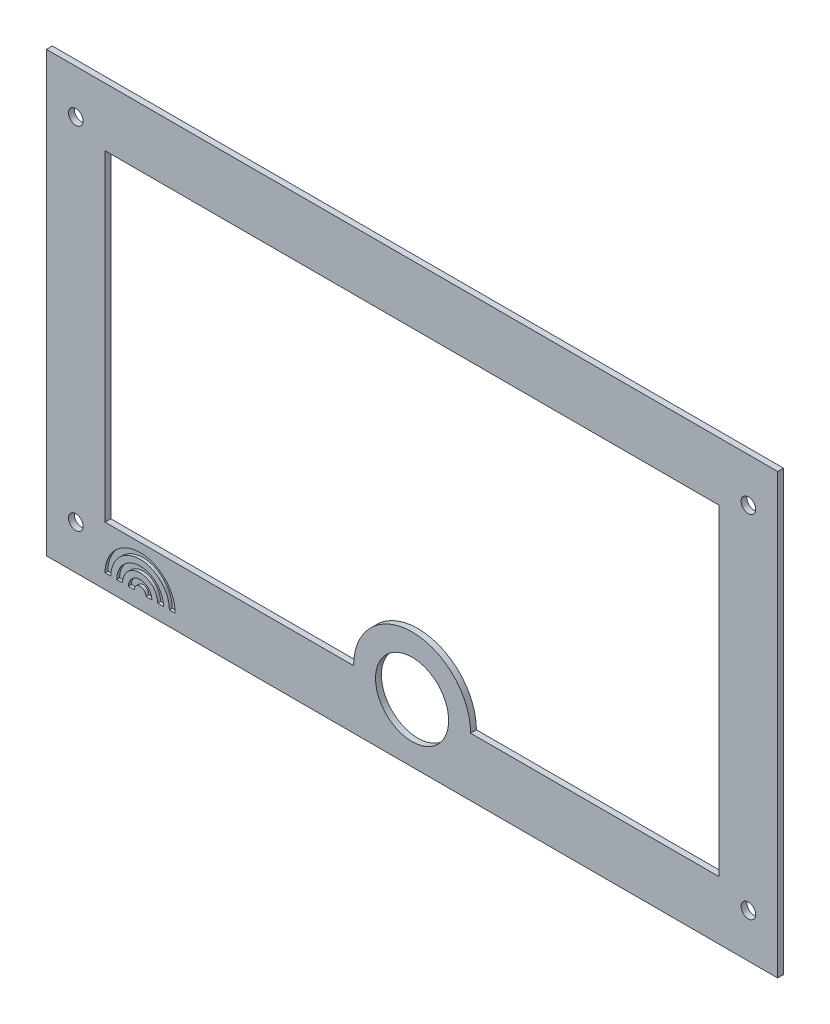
ISO-10303-21;
HEADER;
FILE_DESCRIPTION(('STEP AP214'),'2;1');
FILE_NAME('part.step','',(''),(''),'','','');
FILE_SCHEMA(('AUTOMOTIVE_DESIGN { 1 0 10303 214 1 1 1 1 }'));
ENDSEC;
DATA;
#1=APPLICATION_CONTEXT('core data for automotive mechanical design processes');
#2=APPLICATION_PROTOCOL_DEFINITION('international standard','automotive_design',2000,#1);
#3=PRODUCT_CONTEXT('',#1,'mechanical');
#4=PRODUCT('Part','Part','',(#3));
#5=PRODUCT_RELATED_PRODUCT_CATEGORY('part','',(#4));
#6=PRODUCT_DEFINITION_FORMATION('','',#4);
#7=PRODUCT_DEFINITION_CONTEXT('part definition',#1,'design');
#8=PRODUCT_DEFINITION('design','',#6,#7);
#9=PRODUCT_DEFINITION_SHAPE('','',#8);
#10=(LENGTH_UNIT() NAMED_UNIT(*) SI_UNIT(.MILLI.,.METRE.));
#11=(NAMED_UNIT(*) PLANE_ANGLE_UNIT() SI_UNIT($,.RADIAN.));
#12=(NAMED_UNIT(*) SI_UNIT($,.STERADIAN.) SOLID_ANGLE_UNIT());
#13=UNCERTAINTY_MEASURE_WITH_UNIT(LENGTH_MEASURE(1.E-05),#10,'distance_accuracy_value','');
#14=(GEOMETRIC_REPRESENTATION_CONTEXT(3) GLOBAL_UNCERTAINTY_ASSIGNED_CONTEXT((#13)) GLOBAL_UNIT_ASSIGNED_CONTEXT((#10,
#11,#12)) REPRESENTATION_CONTEXT('',''));
#15=CARTESIAN_POINT('',(0.,0.,0.));
#16=DIRECTION('',(0.,0.,1.));
#17=DIRECTION('',(1.,0.,0.));
#18=AXIS2_PLACEMENT_3D('',#15,#16,#17);
#19=CARTESIAN_POINT('',(-125.,-75.,2.));
#20=DIRECTION('',(0.,-1.,0.));
#21=DIRECTION('',(0.,0.,-1.));
#22=AXIS2_PLACEMENT_3D('',#19,#20,#21);
#23=PLANE('',#22);
#24=DIRECTION('',(1.,0.,0.));
#25=VECTOR('',#24,1.);
#26=CARTESIAN_POINT('',(0.,-75.,2.));
#27=LINE('',#26,#25);
#28=CARTESIAN_POINT('',(-125.,-75.,2.));
#29=VERTEX_POINT('',#28);
#30=CARTESIAN_POINT('',(125.,-75.,2.));
#31=VERTEX_POINT('',#30);
#32=EDGE_CURVE('E307',#29,#31,#27,.T.);
#33=ORIENTED_EDGE('',*,*,#32,.F.);
#34=DIRECTION('',(0.,0.,1.));
#35=VECTOR('',#34,1.);
#36=CARTESIAN_POINT('',(-125.,-75.,1.));
#37=LINE('',#36,#35);
#38=CARTESIAN_POINT('',(-125.,-75.,0.));
#39=VERTEX_POINT('',#38);
#40=EDGE_CURVE('E374',#39,#29,#37,.T.);
#41=ORIENTED_EDGE('',*,*,#40,.F.);
#42=DIRECTION('',(1.,0.,0.));
#43=VECTOR('',#42,1.);
#44=CARTESIAN_POINT('',(0.,-75.,0.));
#45=LINE('',#44,#43);
#46=CARTESIAN_POINT('',(125.,-75.,0.));
#47=VERTEX_POINT('',#46);
#48=EDGE_CURVE('E323',#39,#47,#45,.T.);
#49=ORIENTED_EDGE('',*,*,#48,.T.);
#50=DIRECTION('',(0.,0.,-1.));
#51=VECTOR('',#50,1.);
#52=CARTESIAN_POINT('',(125.,-75.,1.));
#53=LINE('',#52,#51);
#54=EDGE_CURVE('E281',#31,#47,#53,.T.);
#55=ORIENTED_EDGE('',*,*,#54,.F.);
#56=EDGE_LOOP('',(#33,#41,#49,#55));
#57=FACE_BOUND('',#56,.T.);
#58=ADVANCED_FACE('F36',(#57),#23,.T.);
#59=CARTESIAN_POINT('',(125.,-75.,2.));
#60=DIRECTION('',(1.,0.,0.));
#61=DIRECTION('',(0.,0.,-1.));
#62=AXIS2_PLACEMENT_3D('',#59,#60,#61);
#63=PLANE('',#62);
#64=DIRECTION('',(0.,1.,0.));
#65=VECTOR('',#64,1.);
#66=CARTESIAN_POINT('',(125.,0.,2.));
#67=LINE('',#66,#65);
#68=CARTESIAN_POINT('',(125.,75.,2.));
#69=VERTEX_POINT('',#68);
#70=EDGE_CURVE('E305',#31,#69,#67,.T.);
#71=ORIENTED_EDGE('',*,*,#70,.F.);
#72=ORIENTED_EDGE('',*,*,#54,.T.);
#73=DIRECTION('',(0.,1.,0.));
#74=VECTOR('',#73,1.);
#75=CARTESIAN_POINT('',(125.,0.,0.));
#76=LINE('',#75,#74);
#77=CARTESIAN_POINT('',(125.,75.,0.));
#78=VERTEX_POINT('',#77);
#79=EDGE_CURVE('E332',#47,#78,#76,.T.);
#80=ORIENTED_EDGE('',*,*,#79,.T.);
#81=DIRECTION('',(0.,0.,-1.));
#82=VECTOR('',#81,1.);
#83=CARTESIAN_POINT('',(125.,75.,1.));
#84=LINE('',#83,#82);
#85=EDGE_CURVE('E376',#69,#78,#84,.T.);
#86=ORIENTED_EDGE('',*,*,#85,.F.);
#87=EDGE_LOOP('',(#71,#72,#80,#86));
#88=FACE_BOUND('',#87,.T.);
#89=ADVANCED_FACE('F440',(#88),#63,.T.);
#90=CARTESIAN_POINT('',(-125.,75.,0.));
#91=DIRECTION('',(0.,1.,0.));
#92=DIRECTION('',(0.,0.,1.));
#93=AXIS2_PLACEMENT_3D('',#90,#91,#92);
#94=PLANE('',#93);
#95=DIRECTION('',(-1.,0.,0.));
#96=VECTOR('',#95,1.);
#97=CARTESIAN_POINT('',(0.,75.,2.));
#98=LINE('',#97,#96);
#99=CARTESIAN_POINT('',(-125.,75.,2.));
#100=VERTEX_POINT('',#99);
#101=EDGE_CURVE('E303',#69,#100,#98,.T.);
#102=ORIENTED_EDGE('',*,*,#101,.F.);
#103=ORIENTED_EDGE('',*,*,#85,.T.);
#104=DIRECTION('',(-1.,0.,0.));
#105=VECTOR('',#104,1.);
#106=CARTESIAN_POINT('',(0.,75.,0.));
#107=LINE('',#106,#105);
#108=CARTESIAN_POINT('',(-125.,75.,0.));
#109=VERTEX_POINT('',#108);
#110=EDGE_CURVE('E329',#78,#109,#107,.T.);
#111=ORIENTED_EDGE('',*,*,#110,.T.);
#112=DIRECTION('',(0.,0.,-1.));
#113=VECTOR('',#112,1.);
#114=CARTESIAN_POINT('',(-125.,75.,1.));
#115=LINE('',#114,#113);
#116=EDGE_CURVE('E363',#100,#109,#115,.T.);
#117=ORIENTED_EDGE('',*,*,#116,.F.);
#118=EDGE_LOOP('',(#102,#103,#111,#117));
#119=FACE_BOUND('',#118,.T.);
#120=ADVANCED_FACE('F435',(#119),#94,.T.);
#121=CARTESIAN_POINT('',(-125.,-75.,0.));
#122=DIRECTION('',(-1.,0.,0.));
#123=DIRECTION('',(0.,0.,1.));
#124=AXIS2_PLACEMENT_3D('',#121,#122,#123);
#125=PLANE('',#124);
#126=DIRECTION('',(0.,-1.,0.));
#127=VECTOR('',#126,1.);
#128=CARTESIAN_POINT('',(-125.,0.,2.));
#129=LINE('',#128,#127);
#130=EDGE_CURVE('E299',#100,#29,#129,.T.);
#131=ORIENTED_EDGE('',*,*,#130,.F.);
#132=ORIENTED_EDGE('',*,*,#116,.T.);
#133=DIRECTION('',(0.,-1.,0.));
#134=VECTOR('',#133,1.);
#135=CARTESIAN_POINT('',(-125.,0.,0.));
#136=LINE('',#135,#134);
#137=EDGE_CURVE('E326',#109,#39,#136,.T.);
#138=ORIENTED_EDGE('',*,*,#137,.T.);
#139=ORIENTED_EDGE('',*,*,#40,.T.);
#140=EDGE_LOOP('',(#131,#132,#138,#139));
#141=FACE_BOUND('',#140,.T.);
#142=ADVANCED_FACE('F444',(#141),#125,.T.);
#143=CARTESIAN_POINT('',(115.,-60.,0.));
#144=DIRECTION('',(0.,0.,1.));
#145=DIRECTION('',(1.,0.,0.));
#146=AXIS2_PLACEMENT_3D('',#143,#144,#145);
#147=CYLINDRICAL_SURFACE('',#146,2.5);
#148=CARTESIAN_POINT('',(115.,-60.,2.));
#149=DIRECTION('',(0.,0.,1.));
#150=DIRECTION('',(1.,0.,0.));
#151=AXIS2_PLACEMENT_3D('',#148,#149,#150);
#152=CIRCLE('',#151,2.5);
#153=CARTESIAN_POINT('',(117.5,-60.,2.));
#154=VERTEX_POINT('',#153);
#155=EDGE_CURVE('E302',#154,#154,#152,.F.);
#156=ORIENTED_EDGE('',*,*,#155,.F.);
#157=EDGE_LOOP('',(#156));
#158=FACE_BOUND('',#157,.T.);
#159=CARTESIAN_POINT('',(115.,-60.,0.));
#160=DIRECTION('',(0.,0.,1.));
#161=DIRECTION('',(1.,0.,0.));
#162=AXIS2_PLACEMENT_3D('',#159,#160,#161);
#163=CIRCLE('',#162,2.5);
#164=CARTESIAN_POINT('',(117.5,-60.,0.));
#165=VERTEX_POINT('',#164);
#166=EDGE_CURVE('E40',#165,#165,#163,.F.);
#167=ORIENTED_EDGE('',*,*,#166,.T.);
#168=EDGE_LOOP('',(#167));
#169=FACE_BOUND('',#168,.T.);
#170=ADVANCED_FACE('F418',(#158,#169),#147,.F.);
#171=CARTESIAN_POINT('',(115.,60.,0.));
#172=DIRECTION('',(0.,0.,1.));
#173=DIRECTION('',(1.,0.,0.));
#174=AXIS2_PLACEMENT_3D('',#171,#172,#173);
#175=CYLINDRICAL_SURFACE('',#174,2.5);
#176=CARTESIAN_POINT('',(115.,60.,2.));
#177=DIRECTION('',(0.,0.,1.));
#178=DIRECTION('',(1.,0.,0.));
#179=AXIS2_PLACEMENT_3D('',#176,#177,#178);
#180=CIRCLE('',#179,2.5);
#181=CARTESIAN_POINT('',(117.5,60.,2.));
#182=VERTEX_POINT('',#181);
#183=EDGE_CURVE('E401',#182,#182,#180,.F.);
#184=ORIENTED_EDGE('',*,*,#183,.F.);
#185=EDGE_LOOP('',(#184));
#186=FACE_BOUND('',#185,.T.);
#187=CARTESIAN_POINT('',(115.,60.,0.));
#188=DIRECTION('',(0.,0.,1.));
#189=DIRECTION('',(1.,0.,0.));
#190=AXIS2_PLACEMENT_3D('',#187,#188,#189);
#191=CIRCLE('',#190,2.5);
#192=CARTESIAN_POINT('',(117.5,60.,0.));
#193=VERTEX_POINT('',#192);
#194=EDGE_CURVE('E411',#193,#193,#191,.F.);
#195=ORIENTED_EDGE('',*,*,#194,.T.);
#196=EDGE_LOOP('',(#195));
#197=FACE_BOUND('',#196,.T.);
#198=ADVANCED_FACE('F478',(#186,#197),#175,.F.);
#199=CARTESIAN_POINT('',(-115.,60.,0.));
#200=DIRECTION('',(0.,0.,1.));
#201=DIRECTION('',(1.,0.,0.));
#202=AXIS2_PLACEMENT_3D('',#199,#200,#201);
#203=CYLINDRICAL_SURFACE('',#202,2.5);
#204=CARTESIAN_POINT('',(-115.,60.,2.));
#205=DIRECTION('',(0.,0.,1.));
#206=DIRECTION('',(1.,0.,0.));
#207=AXIS2_PLACEMENT_3D('',#204,#205,#206);
#208=CIRCLE('',#207,2.5);
#209=CARTESIAN_POINT('',(-112.5,60.,2.));
#210=VERTEX_POINT('',#209);
#211=EDGE_CURVE('E398',#210,#210,#208,.F.);
#212=ORIENTED_EDGE('',*,*,#211,.F.);
#213=EDGE_LOOP('',(#212));
#214=FACE_BOUND('',#213,.T.);
#215=CARTESIAN_POINT('',(-115.,60.,0.));
#216=DIRECTION('',(0.,0.,1.));
#217=DIRECTION('',(1.,0.,0.));
#218=AXIS2_PLACEMENT_3D('',#215,#216,#217);
#219=CIRCLE('',#218,2.5);
#220=CARTESIAN_POINT('',(-112.5,60.,0.));
#221=VERTEX_POINT('',#220);
#222=EDGE_CURVE('E320',#221,#221,#219,.F.);
#223=ORIENTED_EDGE('',*,*,#222,.T.);
#224=EDGE_LOOP('',(#223));
#225=FACE_BOUND('',#224,.T.);
#226=ADVANCED_FACE('F484',(#214,#225),#203,.F.);
#227=CARTESIAN_POINT('',(0.,-55.,2.));
#228=DIRECTION('',(0.,0.,-1.));
#229=DIRECTION('',(-1.,0.,0.));
#230=AXIS2_PLACEMENT_3D('',#227,#228,#229);
#231=CYLINDRICAL_SURFACE('',#230,12.5);
#232=CARTESIAN_POINT('',(0.,-55.,2.));
#233=DIRECTION('',(0.,0.,-1.));
#234=DIRECTION('',(-1.,0.,0.));
#235=AXIS2_PLACEMENT_3D('',#232,#233,#234);
#236=CIRCLE('',#235,12.5);
#237=CARTESIAN_POINT('',(-12.5,-55.,2.));
#238=VERTEX_POINT('',#237);
#239=EDGE_CURVE('E367',#238,#238,#236,.T.);
#240=ORIENTED_EDGE('',*,*,#239,.F.);
#241=EDGE_LOOP('',(#240));
#242=FACE_BOUND('',#241,.T.);
#243=CARTESIAN_POINT('',(0.,-55.,0.));
#244=DIRECTION('',(0.,0.,-1.));
#245=DIRECTION('',(-1.,0.,0.));
#246=AXIS2_PLACEMENT_3D('',#243,#244,#245);
#247=CIRCLE('',#246,12.5);
#248=CARTESIAN_POINT('',(-12.5,-55.,0.));
#249=VERTEX_POINT('',#248);
#250=EDGE_CURVE('E309',#249,#249,#247,.T.);
#251=ORIENTED_EDGE('',*,*,#250,.T.);
#252=EDGE_LOOP('',(#251));
#253=FACE_BOUND('',#252,.T.);
#254=ADVANCED_FACE('F500',(#242,#253),#231,.F.);
#255=CARTESIAN_POINT('',(105.,55.00000005,0.));
#256=DIRECTION('',(0.,1.,0.));
#257=DIRECTION('',(-1.,0.,0.));
#258=AXIS2_PLACEMENT_3D('',#255,#256,#257);
#259=PLANE('',#258);
#260=DIRECTION('',(0.,0.,1.));
#261=VECTOR('',#260,1.);
#262=CARTESIAN_POINT('',(105.,55.00000005,1.));
#263=LINE('',#262,#261);
#264=CARTESIAN_POINT('',(105.,55.00000005,0.));
#265=VERTEX_POINT('',#264);
#266=CARTESIAN_POINT('',(105.,55.00000005,2.));
#267=VERTEX_POINT('',#266);
#268=EDGE_CURVE('E354',#265,#267,#263,.T.);
#269=ORIENTED_EDGE('',*,*,#268,.T.);
#270=DIRECTION('',(1.,0.,0.));
#271=VECTOR('',#270,1.);
#272=CARTESIAN_POINT('',(0.,55.00000005,2.));
#273=LINE('',#272,#271);
#274=CARTESIAN_POINT('',(-105.,55.00000005,2.));
#275=VERTEX_POINT('',#274);
#276=EDGE_CURVE('E358',#275,#267,#273,.T.);
#277=ORIENTED_EDGE('',*,*,#276,.F.);
#278=DIRECTION('',(0.,0.,-1.));
#279=VECTOR('',#278,1.);
#280=CARTESIAN_POINT('',(-105.,55.00000005,1.));
#281=LINE('',#280,#279);
#282=CARTESIAN_POINT('',(-105.,55.00000005,0.));
#283=VERTEX_POINT('',#282);
#284=EDGE_CURVE('E335',#275,#283,#281,.T.);
#285=ORIENTED_EDGE('',*,*,#284,.T.);
#286=DIRECTION('',(1.,0.,0.));
#287=VECTOR('',#286,1.);
#288=CARTESIAN_POINT('',(0.,55.00000005,0.));
#289=LINE('',#288,#287);
#290=EDGE_CURVE('E381',#283,#265,#289,.T.);
#291=ORIENTED_EDGE('',*,*,#290,.T.);
#292=EDGE_LOOP('',(#269,#277,#285,#291));
#293=FACE_BOUND('',#292,.T.);
#294=ADVANCED_FACE('F496',(#293),#259,.F.);
#295=CARTESIAN_POINT('',(105.,-55.000000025,2.));
#296=DIRECTION('',(1.,0.,0.));
#297=DIRECTION('',(0.,0.,-1.));
#298=AXIS2_PLACEMENT_3D('',#295,#296,#297);
#299=PLANE('',#298);
#300=DIRECTION('',(0.,0.,1.));
#301=VECTOR('',#300,1.);
#302=CARTESIAN_POINT('',(105.,-55.000000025,1.));
#303=LINE('',#302,#301);
#304=CARTESIAN_POINT('',(105.,-55.0000000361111,0.));
#305=VERTEX_POINT('',#304);
#306=CARTESIAN_POINT('',(105.,-55.0000000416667,2.));
#307=VERTEX_POINT('',#306);
#308=EDGE_CURVE('E351',#305,#307,#303,.T.);
#309=ORIENTED_EDGE('',*,*,#308,.T.);
#310=DIRECTION('',(0.,-1.,0.));
#311=VECTOR('',#310,1.);
#312=CARTESIAN_POINT('',(105.,0.,2.));
#313=LINE('',#312,#311);
#314=EDGE_CURVE('E296',#267,#307,#313,.T.);
#315=ORIENTED_EDGE('',*,*,#314,.F.);
#316=ORIENTED_EDGE('',*,*,#268,.F.);
#317=DIRECTION('',(0.,-1.,0.));
#318=VECTOR('',#317,1.);
#319=CARTESIAN_POINT('',(105.,0.,0.));
#320=LINE('',#319,#318);
#321=EDGE_CURVE('E384',#265,#305,#320,.T.);
#322=ORIENTED_EDGE('',*,*,#321,.T.);
#323=EDGE_LOOP('',(#309,#315,#316,#322));
#324=FACE_BOUND('',#323,.T.);
#325=ADVANCED_FACE('F499',(#324),#299,.F.);
#326=CARTESIAN_POINT('',(20.,-55.000000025,2.));
#327=DIRECTION('',(0.,-1.,0.));
#328=DIRECTION('',(0.,0.,-1.));
#329=AXIS2_PLACEMENT_3D('',#326,#327,#328);
#330=PLANE('',#329);
#331=DIRECTION('',(0.,0.,-1.));
#332=VECTOR('',#331,1.);
#333=CARTESIAN_POINT('',(20.,-55.0000000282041,1.));
#334=LINE('',#333,#332);
#335=CARTESIAN_POINT('',(20.,-55.0000000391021,0.));
#336=VERTEX_POINT('',#335);
#337=CARTESIAN_POINT('',(20.,-55.0000000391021,2.));
#338=VERTEX_POINT('',#337);
#339=EDGE_CURVE('E340',#336,#338,#334,.F.);
#340=ORIENTED_EDGE('',*,*,#339,.T.);
#341=DIRECTION('',(-1.,0.,0.));
#342=VECTOR('',#341,1.);
#343=CARTESIAN_POINT('',(0.,-55.00000005,2.));
#344=LINE('',#343,#342);
#345=EDGE_CURVE('E294',#307,#338,#344,.T.);
#346=ORIENTED_EDGE('',*,*,#345,.F.);
#347=ORIENTED_EDGE('',*,*,#308,.F.);
#348=DIRECTION('',(-1.,0.,0.));
#349=VECTOR('',#348,1.);
#350=CARTESIAN_POINT('',(0.,-55.00000005,0.));
#351=LINE('',#350,#349);
#352=EDGE_CURVE('E317',#305,#336,#351,.T.);
#353=ORIENTED_EDGE('',*,*,#352,.T.);
#354=EDGE_LOOP('',(#340,#346,#347,#353));
#355=FACE_BOUND('',#354,.T.);
#356=ADVANCED_FACE('F504',(#355),#330,.F.);
#357=CARTESIAN_POINT('',(0.,-55.,2.));
#358=DIRECTION('',(0.,0.,-1.));
#359=DIRECTION('',(-1.,0.,0.));
#360=AXIS2_PLACEMENT_3D('',#357,#358,#359);
#361=CYLINDRICAL_SURFACE('',#360,20.);
#362=DIRECTION('',(0.,0.,1.));
#363=VECTOR('',#362,1.);
#364=CARTESIAN_POINT('',(-20.,-55.000000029,1.));
#365=LINE('',#364,#363);
#366=CARTESIAN_POINT('',(-20.,-55.0000000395,0.));
#367=VERTEX_POINT('',#366);
#368=CARTESIAN_POINT('',(-20.,-55.0000000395,2.));
#369=VERTEX_POINT('',#368);
#370=EDGE_CURVE('E336',#367,#369,#365,.T.);
#371=ORIENTED_EDGE('',*,*,#370,.T.);
#372=CARTESIAN_POINT('',(0.,-55.,2.));
#373=DIRECTION('',(0.,0.,-1.));
#374=DIRECTION('',(-1.,0.,0.));
#375=AXIS2_PLACEMENT_3D('',#372,#373,#374);
#376=CIRCLE('',#375,20.);
#377=EDGE_CURVE('E291',#338,#369,#376,.F.);
#378=ORIENTED_EDGE('',*,*,#377,.F.);
#379=ORIENTED_EDGE('',*,*,#339,.F.);
#380=CARTESIAN_POINT('',(0.,-55.,0.));
#381=DIRECTION('',(0.,0.,-1.));
#382=DIRECTION('',(-1.,0.,0.));
#383=AXIS2_PLACEMENT_3D('',#380,#381,#382);
#384=CIRCLE('',#383,20.);
#385=EDGE_CURVE('E314',#336,#367,#384,.F.);
#386=ORIENTED_EDGE('',*,*,#385,.T.);
#387=EDGE_LOOP('',(#371,#378,#379,#386));
#388=FACE_BOUND('',#387,.T.);
#389=ADVANCED_FACE('F508',(#388),#361,.T.);
#390=CARTESIAN_POINT('',(-105.,-55.000000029,2.));
#391=DIRECTION('',(0.,-1.,0.));
#392=DIRECTION('',(0.,0.,-1.));
#393=AXIS2_PLACEMENT_3D('',#390,#391,#392);
#394=PLANE('',#393);
#395=DIRECTION('',(0.,0.,1.));
#396=VECTOR('',#395,1.);
#397=CARTESIAN_POINT('',(-105.,-55.000000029,1.));
#398=LINE('',#397,#396);
#399=CARTESIAN_POINT('',(-105.,-55.0000000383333,0.));
#400=VERTEX_POINT('',#399);
#401=CARTESIAN_POINT('',(-105.,-55.000000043,2.));
#402=VERTEX_POINT('',#401);
#403=EDGE_CURVE('E339',#400,#402,#398,.T.);
#404=ORIENTED_EDGE('',*,*,#403,.T.);
#405=DIRECTION('',(-1.,0.,0.));
#406=VECTOR('',#405,1.);
#407=CARTESIAN_POINT('',(0.,-55.00000005,2.));
#408=LINE('',#407,#406);
#409=EDGE_CURVE('E288',#369,#402,#408,.T.);
#410=ORIENTED_EDGE('',*,*,#409,.F.);
#411=ORIENTED_EDGE('',*,*,#370,.F.);
#412=DIRECTION('',(-1.,0.,0.));
#413=VECTOR('',#412,1.);
#414=CARTESIAN_POINT('',(0.,-55.00000005,0.));
#415=LINE('',#414,#413);
#416=EDGE_CURVE('E310',#367,#400,#415,.T.);
#417=ORIENTED_EDGE('',*,*,#416,.T.);
#418=EDGE_LOOP('',(#404,#410,#411,#417));
#419=FACE_BOUND('',#418,.T.);
#420=ADVANCED_FACE('F510',(#419),#394,.F.);
#421=CARTESIAN_POINT('',(-105.,-55.000000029,0.));
#422=DIRECTION('',(-1.,0.,0.));
#423=DIRECTION('',(0.,0.,1.));
#424=AXIS2_PLACEMENT_3D('',#421,#422,#423);
#425=PLANE('',#424);
#426=ORIENTED_EDGE('',*,*,#284,.F.);
#427=DIRECTION('',(0.,1.,0.));
#428=VECTOR('',#427,1.);
#429=CARTESIAN_POINT('',(-105.,0.,2.));
#430=LINE('',#429,#428);
#431=EDGE_CURVE('E290',#402,#275,#430,.T.);
#432=ORIENTED_EDGE('',*,*,#431,.F.);
#433=ORIENTED_EDGE('',*,*,#403,.F.);
#434=DIRECTION('',(0.,1.,0.));
#435=VECTOR('',#434,1.);
#436=CARTESIAN_POINT('',(-105.,0.,0.));
#437=LINE('',#436,#435);
#438=EDGE_CURVE('E313',#400,#283,#437,.T.);
#439=ORIENTED_EDGE('',*,*,#438,.T.);
#440=EDGE_LOOP('',(#426,#432,#433,#439));
#441=FACE_BOUND('',#440,.T.);
#442=ADVANCED_FACE('F423',(#441),#425,.F.);
#443=CARTESIAN_POINT('',(-125.,-75.,0.));
#444=DIRECTION('',(0.,0.,1.));
#445=DIRECTION('',(1.,0.,0.));
#446=AXIS2_PLACEMENT_3D('',#443,#444,#445);
#447=PLANE('',#446);
#448=ORIENTED_EDGE('',*,*,#250,.F.);
#449=EDGE_LOOP('',(#448));
#450=FACE_BOUND('',#449,.T.);
#451=ORIENTED_EDGE('',*,*,#290,.F.);
#452=ORIENTED_EDGE('',*,*,#438,.F.);
#453=ORIENTED_EDGE('',*,*,#416,.F.);
#454=ORIENTED_EDGE('',*,*,#385,.F.);
#455=ORIENTED_EDGE('',*,*,#352,.F.);
#456=ORIENTED_EDGE('',*,*,#321,.F.);
#457=EDGE_LOOP('',(#451,#452,#453,#454,#455,#456));
#458=FACE_BOUND('',#457,.T.);
#459=ORIENTED_EDGE('',*,*,#222,.F.);
#460=EDGE_LOOP('',(#459));
#461=FACE_BOUND('',#460,.T.);
#462=ORIENTED_EDGE('',*,*,#194,.F.);
#463=EDGE_LOOP('',(#462));
#464=FACE_BOUND('',#463,.T.);
#465=ORIENTED_EDGE('',*,*,#166,.F.);
#466=EDGE_LOOP('',(#465));
#467=FACE_BOUND('',#466,.T.);
#468=CARTESIAN_POINT('',(-115.,-60.,0.));
#469=DIRECTION('',(0.,0.,1.));
#470=DIRECTION('',(1.,0.,0.));
#471=AXIS2_PLACEMENT_3D('',#468,#469,#470);
#472=CIRCLE('',#471,2.5);
#473=CARTESIAN_POINT('',(-112.5,-60.,0.));
#474=VERTEX_POINT('',#473);
#475=EDGE_CURVE('E45',#474,#474,#472,.F.);
#476=ORIENTED_EDGE('',*,*,#475,.F.);
#477=EDGE_LOOP('',(#476));
#478=FACE_BOUND('',#477,.T.);
#479=ORIENTED_EDGE('',*,*,#137,.F.);
#480=ORIENTED_EDGE('',*,*,#110,.F.);
#481=ORIENTED_EDGE('',*,*,#79,.F.);
#482=ORIENTED_EDGE('',*,*,#48,.F.);
#483=EDGE_LOOP('',(#479,#480,#481,#482));
#484=FACE_BOUND('',#483,.T.);
#485=ADVANCED_FACE('F420',(#450,#458,#461,#464,#467,#478,#484),#447,.F.);
#486=CARTESIAN_POINT('',(-125.,-75.,2.));
#487=DIRECTION('',(0.,0.,1.));
#488=DIRECTION('',(1.,0.,0.));
#489=AXIS2_PLACEMENT_3D('',#486,#487,#488);
#490=PLANE('',#489);
#491=CARTESIAN_POINT('',(-93.,-70.,2.));
#492=DIRECTION('',(0.,0.,-1.));
#493=DIRECTION('',(1.,0.,0.));
#494=AXIS2_PLACEMENT_3D('',#491,#492,#493);
#495=CIRCLE('',#494,5.99999999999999);
#496=CARTESIAN_POINT('',(-98.9999999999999,-70.,2.));
#497=VERTEX_POINT('',#496);
#498=CARTESIAN_POINT('',(-87.,-70.,2.));
#499=VERTEX_POINT('',#498);
#500=EDGE_CURVE('E53',#497,#499,#495,.T.);
#501=ORIENTED_EDGE('',*,*,#500,.F.);
#502=DIRECTION('',(1.,0.,0.));
#503=VECTOR('',#502,1.);
#504=CARTESIAN_POINT('',(-101.,-70.,2.));
#505=LINE('',#504,#503);
#506=CARTESIAN_POINT('',(-101.,-70.,2.));
#507=VERTEX_POINT('',#506);
#508=EDGE_CURVE('E207',#507,#497,#505,.T.);
#509=ORIENTED_EDGE('',*,*,#508,.F.);
#510=CARTESIAN_POINT('',(-93.,-70.,2.));
#511=DIRECTION('',(0.,0.,1.));
#512=DIRECTION('',(1.,0.,0.));
#513=AXIS2_PLACEMENT_3D('',#510,#511,#512);
#514=CIRCLE('',#513,8.00000000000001);
#515=CARTESIAN_POINT('',(-85.,-70.,2.));
#516=VERTEX_POINT('',#515);
#517=EDGE_CURVE('E210',#516,#507,#514,.T.);
#518=ORIENTED_EDGE('',*,*,#517,.F.);
#519=DIRECTION('',(1.,0.,0.));
#520=VECTOR('',#519,1.);
#521=CARTESIAN_POINT('',(-87.,-70.,2.));
#522=LINE('',#521,#520);
#523=EDGE_CURVE('E216',#499,#516,#522,.T.);
#524=ORIENTED_EDGE('',*,*,#523,.F.);
#525=EDGE_LOOP('',(#501,#509,#518,#524));
#526=FACE_BOUND('',#525,.T.);
#527=CARTESIAN_POINT('',(-93.,-70.,2.));
#528=DIRECTION('',(0.,0.,-1.));
#529=DIRECTION('',(1.,0.,0.));
#530=AXIS2_PLACEMENT_3D('',#527,#528,#529);
#531=CIRCLE('',#530,2.);
#532=CARTESIAN_POINT('',(-95.,-70.,2.));
#533=VERTEX_POINT('',#532);
#534=CARTESIAN_POINT('',(-91.,-70.,2.));
#535=VERTEX_POINT('',#534);
#536=EDGE_CURVE('E61',#533,#535,#531,.T.);
#537=ORIENTED_EDGE('',*,*,#536,.F.);
#538=DIRECTION('',(1.,0.,0.));
#539=VECTOR('',#538,1.);
#540=CARTESIAN_POINT('',(-97.,-70.,2.));
#541=LINE('',#540,#539);
#542=CARTESIAN_POINT('',(-97.,-70.,2.));
#543=VERTEX_POINT('',#542);
#544=EDGE_CURVE('E229',#543,#533,#541,.T.);
#545=ORIENTED_EDGE('',*,*,#544,.F.);
#546=CARTESIAN_POINT('',(-93.,-70.,2.));
#547=DIRECTION('',(0.,0.,1.));
#548=DIRECTION('',(1.,0.,0.));
#549=AXIS2_PLACEMENT_3D('',#546,#547,#548);
#550=CIRCLE('',#549,4.);
#551=CARTESIAN_POINT('',(-89.,-70.,2.));
#552=VERTEX_POINT('',#551);
#553=EDGE_CURVE('E243',#552,#543,#550,.T.);
#554=ORIENTED_EDGE('',*,*,#553,.F.);
#555=DIRECTION('',(1.,0.,0.));
#556=VECTOR('',#555,1.);
#557=CARTESIAN_POINT('',(-91.,-70.,2.));
#558=LINE('',#557,#556);
#559=EDGE_CURVE('E240',#535,#552,#558,.T.);
#560=ORIENTED_EDGE('',*,*,#559,.F.);
#561=EDGE_LOOP('',(#537,#545,#554,#560));
#562=FACE_BOUND('',#561,.T.);
#563=CARTESIAN_POINT('',(-93.,-70.,2.));
#564=DIRECTION('',(0.,0.,1.));
#565=DIRECTION('',(1.,0.,0.));
#566=AXIS2_PLACEMENT_3D('',#563,#564,#565);
#567=CIRCLE('',#566,12.);
#568=CARTESIAN_POINT('',(-80.9999999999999,-70.,2.));
#569=VERTEX_POINT('',#568);
#570=CARTESIAN_POINT('',(-105.,-70.,2.));
#571=VERTEX_POINT('',#570);
#572=EDGE_CURVE('E250',#569,#571,#567,.T.);
#573=ORIENTED_EDGE('',*,*,#572,.F.);
#574=DIRECTION('',(1.,0.,0.));
#575=VECTOR('',#574,1.);
#576=CARTESIAN_POINT('',(-82.9999999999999,-70.,2.));
#577=LINE('',#576,#575);
#578=CARTESIAN_POINT('',(-82.9999999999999,-70.,2.));
#579=VERTEX_POINT('',#578);
#580=EDGE_CURVE('E260',#579,#569,#577,.T.);
#581=ORIENTED_EDGE('',*,*,#580,.F.);
#582=CARTESIAN_POINT('',(-93.,-70.,2.));
#583=DIRECTION('',(0.,0.,-1.));
#584=DIRECTION('',(1.,0.,0.));
#585=AXIS2_PLACEMENT_3D('',#582,#583,#584);
#586=CIRCLE('',#585,10.);
#587=CARTESIAN_POINT('',(-103.,-70.,2.));
#588=VERTEX_POINT('',#587);
#589=EDGE_CURVE('E274',#588,#579,#586,.T.);
#590=ORIENTED_EDGE('',*,*,#589,.F.);
#591=DIRECTION('',(1.,0.,0.));
#592=VECTOR('',#591,1.);
#593=CARTESIAN_POINT('',(-105.,-70.,2.));
#594=LINE('',#593,#592);
#595=EDGE_CURVE('E271',#571,#588,#594,.T.);
#596=ORIENTED_EDGE('',*,*,#595,.F.);
#597=EDGE_LOOP('',(#573,#581,#590,#596));
#598=FACE_BOUND('',#597,.T.);
#599=ORIENTED_EDGE('',*,*,#409,.T.);
#600=ORIENTED_EDGE('',*,*,#431,.T.);
#601=ORIENTED_EDGE('',*,*,#276,.T.);
#602=ORIENTED_EDGE('',*,*,#314,.T.);
#603=ORIENTED_EDGE('',*,*,#345,.T.);
#604=ORIENTED_EDGE('',*,*,#377,.T.);
#605=EDGE_LOOP('',(#599,#600,#601,#602,#603,#604));
#606=FACE_BOUND('',#605,.T.);
#607=ORIENTED_EDGE('',*,*,#239,.T.);
#608=EDGE_LOOP('',(#607));
#609=FACE_BOUND('',#608,.T.);
#610=ORIENTED_EDGE('',*,*,#211,.T.);
#611=EDGE_LOOP('',(#610));
#612=FACE_BOUND('',#611,.T.);
#613=ORIENTED_EDGE('',*,*,#183,.T.);
#614=EDGE_LOOP('',(#613));
#615=FACE_BOUND('',#614,.T.);
#616=ORIENTED_EDGE('',*,*,#155,.T.);
#617=EDGE_LOOP('',(#616));
#618=FACE_BOUND('',#617,.T.);
#619=CARTESIAN_POINT('',(-115.,-60.,2.));
#620=DIRECTION('',(0.,0.,1.));
#621=DIRECTION('',(1.,0.,0.));
#622=AXIS2_PLACEMENT_3D('',#619,#620,#621);
#623=CIRCLE('',#622,2.5);
#624=CARTESIAN_POINT('',(-112.5,-60.,2.));
#625=VERTEX_POINT('',#624);
#626=EDGE_CURVE('E11',#625,#625,#623,.T.);
#627=ORIENTED_EDGE('',*,*,#626,.F.);
#628=EDGE_LOOP('',(#627));
#629=FACE_BOUND('',#628,.T.);
#630=ORIENTED_EDGE('',*,*,#101,.T.);
#631=ORIENTED_EDGE('',*,*,#130,.T.);
#632=ORIENTED_EDGE('',*,*,#32,.T.);
#633=ORIENTED_EDGE('',*,*,#70,.T.);
#634=EDGE_LOOP('',(#630,#631,#632,#633));
#635=FACE_BOUND('',#634,.T.);
#636=ADVANCED_FACE('F38',(#526,#562,#598,#606,#609,#612,#615,#618,#629,#635),#490,.T.);
#637=CARTESIAN_POINT('',(-115.,-60.,0.));
#638=DIRECTION('',(0.,0.,1.));
#639=DIRECTION('',(1.,0.,0.));
#640=AXIS2_PLACEMENT_3D('',#637,#638,#639);
#641=CYLINDRICAL_SURFACE('',#640,2.5);
#642=ORIENTED_EDGE('',*,*,#626,.T.);
#643=EDGE_LOOP('',(#642));
#644=FACE_BOUND('',#643,.T.);
#645=ORIENTED_EDGE('',*,*,#475,.T.);
#646=EDGE_LOOP('',(#645));
#647=FACE_BOUND('',#646,.T.);
#648=ADVANCED_FACE('F447',(#644,#647),#641,.F.);
#649=CARTESIAN_POINT('',(-93.,-70.,1.));
#650=DIRECTION('',(0.,0.,1.));
#651=DIRECTION('',(1.,0.,0.));
#652=AXIS2_PLACEMENT_3D('',#649,#650,#651);
#653=CYLINDRICAL_SURFACE('',#652,12.);
#654=ORIENTED_EDGE('',*,*,#572,.T.);
#655=DIRECTION('',(0.,0.,1.));
#656=VECTOR('',#655,1.);
#657=CARTESIAN_POINT('',(-105.,-70.,1.));
#658=LINE('',#657,#656);
#659=CARTESIAN_POINT('',(-105.,-70.,1.));
#660=VERTEX_POINT('',#659);
#661=EDGE_CURVE('E269',#660,#571,#658,.T.);
#662=ORIENTED_EDGE('',*,*,#661,.F.);
#663=CARTESIAN_POINT('',(-93.,-70.,1.));
#664=DIRECTION('',(0.,0.,1.));
#665=DIRECTION('',(1.,0.,0.));
#666=AXIS2_PLACEMENT_3D('',#663,#664,#665);
#667=CIRCLE('',#666,12.);
#668=CARTESIAN_POINT('',(-80.9999999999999,-70.,1.));
#669=VERTEX_POINT('',#668);
#670=EDGE_CURVE('E256',#669,#660,#667,.T.);
#671=ORIENTED_EDGE('',*,*,#670,.F.);
#672=DIRECTION('',(0.,0.,1.));
#673=VECTOR('',#672,1.);
#674=CARTESIAN_POINT('',(-80.9999999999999,-70.,1.));
#675=LINE('',#674,#673);
#676=EDGE_CURVE('E279',#669,#569,#675,.T.);
#677=ORIENTED_EDGE('',*,*,#676,.T.);
#678=EDGE_LOOP('',(#654,#662,#671,#677));
#679=FACE_BOUND('',#678,.T.);
#680=ADVANCED_FACE('F452',(#679),#653,.F.);
#681=CARTESIAN_POINT('',(-82.9999999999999,-70.,1.));
#682=DIRECTION('',(0.,-1.,0.));
#683=DIRECTION('',(0.,0.,-1.));
#684=AXIS2_PLACEMENT_3D('',#681,#682,#683);
#685=PLANE('',#684);
#686=ORIENTED_EDGE('',*,*,#580,.T.);
#687=ORIENTED_EDGE('',*,*,#676,.F.);
#688=DIRECTION('',(1.,0.,0.));
#689=VECTOR('',#688,1.);
#690=CARTESIAN_POINT('',(-82.9999999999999,-70.,1.));
#691=LINE('',#690,#689);
#692=CARTESIAN_POINT('',(-82.9999999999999,-70.,1.));
#693=VERTEX_POINT('',#692);
#694=EDGE_CURVE('E266',#693,#669,#691,.T.);
#695=ORIENTED_EDGE('',*,*,#694,.F.);
#696=DIRECTION('',(0.,0.,1.));
#697=VECTOR('',#696,1.);
#698=CARTESIAN_POINT('',(-82.9999999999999,-70.,1.));
#699=LINE('',#698,#697);
#700=EDGE_CURVE('E282',#693,#579,#699,.T.);
#701=ORIENTED_EDGE('',*,*,#700,.T.);
#702=EDGE_LOOP('',(#686,#687,#695,#701));
#703=FACE_BOUND('',#702,.T.);
#704=ADVANCED_FACE('F547',(#703),#685,.F.);
#705=CARTESIAN_POINT('',(-93.,-70.,1.));
#706=DIRECTION('',(0.,0.,1.));
#707=DIRECTION('',(1.,0.,0.));
#708=AXIS2_PLACEMENT_3D('',#705,#706,#707);
#709=CYLINDRICAL_SURFACE('',#708,10.);
#710=ORIENTED_EDGE('',*,*,#589,.T.);
#711=ORIENTED_EDGE('',*,*,#700,.F.);
#712=CARTESIAN_POINT('',(-93.,-70.,1.));
#713=DIRECTION('',(0.,0.,-1.));
#714=DIRECTION('',(1.,0.,0.));
#715=AXIS2_PLACEMENT_3D('',#712,#713,#714);
#716=CIRCLE('',#715,10.);
#717=CARTESIAN_POINT('',(-103.,-70.,1.));
#718=VERTEX_POINT('',#717);
#719=EDGE_CURVE('E263',#718,#693,#716,.T.);
#720=ORIENTED_EDGE('',*,*,#719,.F.);
#721=DIRECTION('',(0.,0.,1.));
#722=VECTOR('',#721,1.);
#723=CARTESIAN_POINT('',(-103.,-70.,1.));
#724=LINE('',#723,#722);
#725=EDGE_CURVE('E284',#718,#588,#724,.T.);
#726=ORIENTED_EDGE('',*,*,#725,.T.);
#727=EDGE_LOOP('',(#710,#711,#720,#726));
#728=FACE_BOUND('',#727,.T.);
#729=ADVANCED_FACE('F553',(#728),#709,.T.);
#730=CARTESIAN_POINT('',(-105.,-70.,1.));
#731=DIRECTION('',(0.,-1.,0.));
#732=DIRECTION('',(0.,0.,-1.));
#733=AXIS2_PLACEMENT_3D('',#730,#731,#732);
#734=PLANE('',#733);
#735=ORIENTED_EDGE('',*,*,#595,.T.);
#736=ORIENTED_EDGE('',*,*,#725,.F.);
#737=DIRECTION('',(1.,0.,0.));
#738=VECTOR('',#737,1.);
#739=CARTESIAN_POINT('',(-105.,-70.,1.));
#740=LINE('',#739,#738);
#741=EDGE_CURVE('E259',#660,#718,#740,.T.);
#742=ORIENTED_EDGE('',*,*,#741,.F.);
#743=ORIENTED_EDGE('',*,*,#661,.T.);
#744=EDGE_LOOP('',(#735,#736,#742,#743));
#745=FACE_BOUND('',#744,.T.);
#746=ADVANCED_FACE('F549',(#745),#734,.F.);
#747=CARTESIAN_POINT('',(-93.,-70.,1.));
#748=DIRECTION('',(0.,0.,1.));
#749=DIRECTION('',(1.,0.,0.));
#750=AXIS2_PLACEMENT_3D('',#747,#748,#749);
#751=PLANE('',#750);
#752=ORIENTED_EDGE('',*,*,#670,.T.);
#753=ORIENTED_EDGE('',*,*,#741,.T.);
#754=ORIENTED_EDGE('',*,*,#719,.T.);
#755=ORIENTED_EDGE('',*,*,#694,.T.);
#756=EDGE_LOOP('',(#752,#753,#754,#755));
#757=FACE_BOUND('',#756,.T.);
#758=ADVANCED_FACE('F552',(#757),#751,.T.);
#759=CARTESIAN_POINT('',(-93.,-70.,1.));
#760=DIRECTION('',(0.,0.,1.));
#761=DIRECTION('',(1.,0.,0.));
#762=AXIS2_PLACEMENT_3D('',#759,#760,#761);
#763=CYLINDRICAL_SURFACE('',#762,2.);
#764=ORIENTED_EDGE('',*,*,#536,.T.);
#765=DIRECTION('',(0.,0.,1.));
#766=VECTOR('',#765,1.);
#767=CARTESIAN_POINT('',(-91.,-70.,1.));
#768=LINE('',#767,#766);
#769=CARTESIAN_POINT('',(-91.,-70.,1.));
#770=VERTEX_POINT('',#769);
#771=EDGE_CURVE('E238',#770,#535,#768,.T.);
#772=ORIENTED_EDGE('',*,*,#771,.F.);
#773=CARTESIAN_POINT('',(-93.,-70.,1.));
#774=DIRECTION('',(0.,0.,-1.));
#775=DIRECTION('',(1.,0.,0.));
#776=AXIS2_PLACEMENT_3D('',#773,#774,#775);
#777=CIRCLE('',#776,2.);
#778=CARTESIAN_POINT('',(-95.,-70.,1.));
#779=VERTEX_POINT('',#778);
#780=EDGE_CURVE('E225',#779,#770,#777,.T.);
#781=ORIENTED_EDGE('',*,*,#780,.F.);
#782=DIRECTION('',(0.,0.,1.));
#783=VECTOR('',#782,1.);
#784=CARTESIAN_POINT('',(-95.,-70.,1.));
#785=LINE('',#784,#783);
#786=EDGE_CURVE('E248',#779,#533,#785,.T.);
#787=ORIENTED_EDGE('',*,*,#786,.T.);
#788=EDGE_LOOP('',(#764,#772,#781,#787));
#789=FACE_BOUND('',#788,.T.);
#790=ADVANCED_FACE('F563',(#789),#763,.T.);
#791=CARTESIAN_POINT('',(-97.,-70.,1.));
#792=DIRECTION('',(0.,-1.,0.));
#793=DIRECTION('',(0.,0.,-1.));
#794=AXIS2_PLACEMENT_3D('',#791,#792,#793);
#795=PLANE('',#794);
#796=ORIENTED_EDGE('',*,*,#544,.T.);
#797=ORIENTED_EDGE('',*,*,#786,.F.);
#798=DIRECTION('',(1.,0.,0.));
#799=VECTOR('',#798,1.);
#800=CARTESIAN_POINT('',(-97.,-70.,1.));
#801=LINE('',#800,#799);
#802=CARTESIAN_POINT('',(-97.,-70.,1.));
#803=VERTEX_POINT('',#802);
#804=EDGE_CURVE('E235',#803,#779,#801,.T.);
#805=ORIENTED_EDGE('',*,*,#804,.F.);
#806=DIRECTION('',(0.,0.,1.));
#807=VECTOR('',#806,1.);
#808=CARTESIAN_POINT('',(-97.,-70.,1.));
#809=LINE('',#808,#807);
#810=EDGE_CURVE('E251',#803,#543,#809,.T.);
#811=ORIENTED_EDGE('',*,*,#810,.T.);
#812=EDGE_LOOP('',(#796,#797,#805,#811));
#813=FACE_BOUND('',#812,.T.);
#814=ADVANCED_FACE('F567',(#813),#795,.F.);
#815=CARTESIAN_POINT('',(-93.,-70.,1.));
#816=DIRECTION('',(0.,0.,1.));
#817=DIRECTION('',(1.,0.,0.));
#818=AXIS2_PLACEMENT_3D('',#815,#816,#817);
#819=CYLINDRICAL_SURFACE('',#818,4.);
#820=ORIENTED_EDGE('',*,*,#553,.T.);
#821=ORIENTED_EDGE('',*,*,#810,.F.);
#822=CARTESIAN_POINT('',(-93.,-70.,1.));
#823=DIRECTION('',(0.,0.,1.));
#824=DIRECTION('',(1.,0.,0.));
#825=AXIS2_PLACEMENT_3D('',#822,#823,#824);
#826=CIRCLE('',#825,4.);
#827=CARTESIAN_POINT('',(-89.,-70.,1.));
#828=VERTEX_POINT('',#827);
#829=EDGE_CURVE('E232',#828,#803,#826,.T.);
#830=ORIENTED_EDGE('',*,*,#829,.F.);
#831=DIRECTION('',(0.,0.,1.));
#832=VECTOR('',#831,1.);
#833=CARTESIAN_POINT('',(-89.,-70.,1.));
#834=LINE('',#833,#832);
#835=EDGE_CURVE('E253',#828,#552,#834,.T.);
#836=ORIENTED_EDGE('',*,*,#835,.T.);
#837=EDGE_LOOP('',(#820,#821,#830,#836));
#838=FACE_BOUND('',#837,.T.);
#839=ADVANCED_FACE('F572',(#838),#819,.F.);
#840=CARTESIAN_POINT('',(-91.,-70.,1.));
#841=DIRECTION('',(0.,-1.,0.));
#842=DIRECTION('',(0.,0.,-1.));
#843=AXIS2_PLACEMENT_3D('',#840,#841,#842);
#844=PLANE('',#843);
#845=ORIENTED_EDGE('',*,*,#559,.T.);
#846=ORIENTED_EDGE('',*,*,#835,.F.);
#847=DIRECTION('',(1.,0.,0.));
#848=VECTOR('',#847,1.);
#849=CARTESIAN_POINT('',(-91.,-70.,1.));
#850=LINE('',#849,#848);
#851=EDGE_CURVE('E228',#770,#828,#850,.T.);
#852=ORIENTED_EDGE('',*,*,#851,.F.);
#853=ORIENTED_EDGE('',*,*,#771,.T.);
#854=EDGE_LOOP('',(#845,#846,#852,#853));
#855=FACE_BOUND('',#854,.T.);
#856=ADVANCED_FACE('F568',(#855),#844,.F.);
#857=CARTESIAN_POINT('',(-93.,-70.,1.));
#858=DIRECTION('',(0.,0.,1.));
#859=DIRECTION('',(1.,0.,0.));
#860=AXIS2_PLACEMENT_3D('',#857,#858,#859);
#861=PLANE('',#860);
#862=ORIENTED_EDGE('',*,*,#780,.T.);
#863=ORIENTED_EDGE('',*,*,#851,.T.);
#864=ORIENTED_EDGE('',*,*,#829,.T.);
#865=ORIENTED_EDGE('',*,*,#804,.T.);
#866=EDGE_LOOP('',(#862,#863,#864,#865));
#867=FACE_BOUND('',#866,.T.);
#868=ADVANCED_FACE('F571',(#867),#861,.T.);
#869=CARTESIAN_POINT('',(-93.,-70.,1.));
#870=DIRECTION('',(0.,0.,1.));
#871=DIRECTION('',(1.,0.,0.));
#872=AXIS2_PLACEMENT_3D('',#869,#870,#871);
#873=CYLINDRICAL_SURFACE('',#872,5.99999999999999);
#874=ORIENTED_EDGE('',*,*,#500,.T.);
#875=DIRECTION('',(0.,0.,1.));
#876=VECTOR('',#875,1.);
#877=CARTESIAN_POINT('',(-87.,-70.,1.));
#878=LINE('',#877,#876);
#879=CARTESIAN_POINT('',(-87.,-70.,1.));
#880=VERTEX_POINT('',#879);
#881=EDGE_CURVE('E185',#880,#499,#878,.T.);
#882=ORIENTED_EDGE('',*,*,#881,.F.);
#883=CARTESIAN_POINT('',(-93.,-70.,1.));
#884=DIRECTION('',(0.,0.,-1.));
#885=DIRECTION('',(1.,0.,0.));
#886=AXIS2_PLACEMENT_3D('',#883,#884,#885);
#887=CIRCLE('',#886,5.99999999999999);
#888=CARTESIAN_POINT('',(-98.9999999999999,-70.,1.));
#889=VERTEX_POINT('',#888);
#890=EDGE_CURVE('E189',#889,#880,#887,.T.);
#891=ORIENTED_EDGE('',*,*,#890,.F.);
#892=DIRECTION('',(0.,0.,1.));
#893=VECTOR('',#892,1.);
#894=CARTESIAN_POINT('',(-98.9999999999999,-70.,1.));
#895=LINE('',#894,#893);
#896=EDGE_CURVE('E220',#889,#497,#895,.T.);
#897=ORIENTED_EDGE('',*,*,#896,.T.);
#898=EDGE_LOOP('',(#874,#882,#891,#897));
#899=FACE_BOUND('',#898,.T.);
#900=ADVANCED_FACE('F187',(#899),#873,.T.);
#901=CARTESIAN_POINT('',(-101.,-70.,1.));
#902=DIRECTION('',(0.,-1.,0.));
#903=DIRECTION('',(0.,0.,-1.));
#904=AXIS2_PLACEMENT_3D('',#901,#902,#903);
#905=PLANE('',#904);
#906=ORIENTED_EDGE('',*,*,#508,.T.);
#907=ORIENTED_EDGE('',*,*,#896,.F.);
#908=DIRECTION('',(1.,0.,0.));
#909=VECTOR('',#908,1.);
#910=CARTESIAN_POINT('',(-101.,-70.,1.));
#911=LINE('',#910,#909);
#912=CARTESIAN_POINT('',(-101.,-70.,1.));
#913=VERTEX_POINT('',#912);
#914=EDGE_CURVE('E195',#913,#889,#911,.T.);
#915=ORIENTED_EDGE('',*,*,#914,.F.);
#916=DIRECTION('',(0.,0.,1.));
#917=VECTOR('',#916,1.);
#918=CARTESIAN_POINT('',(-101.,-70.,1.));
#919=LINE('',#918,#917);
#920=EDGE_CURVE('E222',#913,#507,#919,.T.);
#921=ORIENTED_EDGE('',*,*,#920,.T.);
#922=EDGE_LOOP('',(#906,#907,#915,#921));
#923=FACE_BOUND('',#922,.T.);
#924=ADVANCED_FACE('F585',(#923),#905,.F.);
#925=CARTESIAN_POINT('',(-93.,-70.,1.));
#926=DIRECTION('',(0.,0.,1.));
#927=DIRECTION('',(1.,0.,0.));
#928=AXIS2_PLACEMENT_3D('',#925,#926,#927);
#929=CYLINDRICAL_SURFACE('',#928,8.00000000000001);
#930=ORIENTED_EDGE('',*,*,#517,.T.);
#931=ORIENTED_EDGE('',*,*,#920,.F.);
#932=CARTESIAN_POINT('',(-93.,-70.,1.));
#933=DIRECTION('',(0.,0.,1.));
#934=DIRECTION('',(1.,0.,0.));
#935=AXIS2_PLACEMENT_3D('',#932,#933,#934);
#936=CIRCLE('',#935,8.00000000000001);
#937=CARTESIAN_POINT('',(-85.,-70.,1.));
#938=VERTEX_POINT('',#937);
#939=EDGE_CURVE('E203',#938,#913,#936,.T.);
#940=ORIENTED_EDGE('',*,*,#939,.F.);
#941=DIRECTION('',(0.,0.,1.));
#942=VECTOR('',#941,1.);
#943=CARTESIAN_POINT('',(-85.,-70.,1.));
#944=LINE('',#943,#942);
#945=EDGE_CURVE('E194',#938,#516,#944,.T.);
#946=ORIENTED_EDGE('',*,*,#945,.T.);
#947=EDGE_LOOP('',(#930,#931,#940,#946));
#948=FACE_BOUND('',#947,.T.);
#949=ADVANCED_FACE('F588',(#948),#929,.F.);
#950=CARTESIAN_POINT('',(-87.,-70.,1.));
#951=DIRECTION('',(0.,-1.,0.));
#952=DIRECTION('',(0.,0.,-1.));
#953=AXIS2_PLACEMENT_3D('',#950,#951,#952);
#954=PLANE('',#953);
#955=ORIENTED_EDGE('',*,*,#523,.T.);
#956=ORIENTED_EDGE('',*,*,#945,.F.);
#957=DIRECTION('',(1.,0.,0.));
#958=VECTOR('',#957,1.);
#959=CARTESIAN_POINT('',(-87.,-70.,1.));
#960=LINE('',#959,#958);
#961=EDGE_CURVE('E198',#880,#938,#960,.T.);
#962=ORIENTED_EDGE('',*,*,#961,.F.);
#963=ORIENTED_EDGE('',*,*,#881,.T.);
#964=EDGE_LOOP('',(#955,#956,#962,#963));
#965=FACE_BOUND('',#964,.T.);
#966=ADVANCED_FACE('F199',(#965),#954,.F.);
#967=CARTESIAN_POINT('',(-93.,-70.,1.));
#968=DIRECTION('',(0.,0.,1.));
#969=DIRECTION('',(1.,0.,0.));
#970=AXIS2_PLACEMENT_3D('',#967,#968,#969);
#971=PLANE('',#970);
#972=ORIENTED_EDGE('',*,*,#890,.T.);
#973=ORIENTED_EDGE('',*,*,#961,.T.);
#974=ORIENTED_EDGE('',*,*,#939,.T.);
#975=ORIENTED_EDGE('',*,*,#914,.T.);
#976=EDGE_LOOP('',(#972,#973,#974,#975));
#977=FACE_BOUND('',#976,.T.);
#978=ADVANCED_FACE('F205',(#977),#971,.T.);
#979=CLOSED_SHELL('',(#58,#89,#120,#142,#170,#198,#226,#254,#294,#325,#356,#389,#420,#442,#485,
#636,#648,#680,#704,#729,#746,#758,#790,#814,#839,#856,#868,#900,#924,#949,#966,#978));
#980=MANIFOLD_SOLID_BREP('B2',#979);
#981=ADVANCED_BREP_SHAPE_REPRESENTATION('',(#18,#980),#14);
#982=SHAPE_DEFINITION_REPRESENTATION(#9,#981);
ENDSEC;
END-ISO-10303-21;
